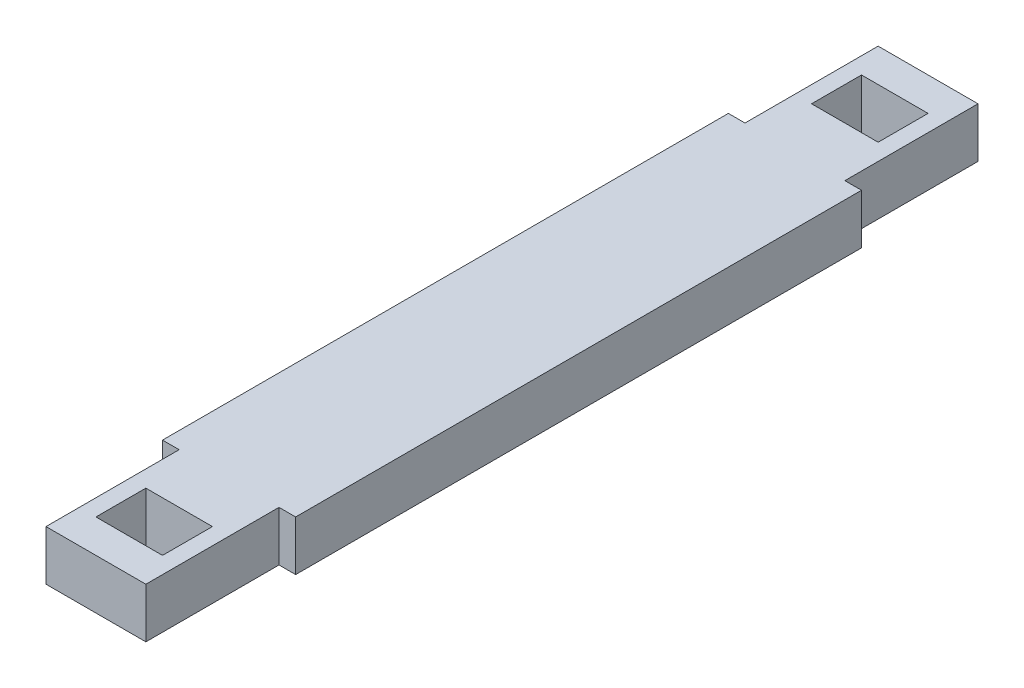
ISO-10303-21;
HEADER;
FILE_DESCRIPTION(('STEP AP214'),'2;1');
FILE_NAME('part.step','',(''),(''),'','','');
FILE_SCHEMA(('AUTOMOTIVE_DESIGN { 1 0 10303 214 1 1 1 1 }'));
ENDSEC;
DATA;
#1=APPLICATION_CONTEXT('core data for automotive mechanical design processes');
#2=APPLICATION_PROTOCOL_DEFINITION('international standard','automotive_design',2000,#1);
#3=PRODUCT_CONTEXT('',#1,'mechanical');
#4=PRODUCT('Part','Part','',(#3));
#5=PRODUCT_RELATED_PRODUCT_CATEGORY('part','',(#4));
#6=PRODUCT_DEFINITION_FORMATION('','',#4);
#7=PRODUCT_DEFINITION_CONTEXT('part definition',#1,'design');
#8=PRODUCT_DEFINITION('design','',#6,#7);
#9=PRODUCT_DEFINITION_SHAPE('','',#8);
#10=(LENGTH_UNIT() NAMED_UNIT(*) SI_UNIT(.MILLI.,.METRE.));
#11=(NAMED_UNIT(*) PLANE_ANGLE_UNIT() SI_UNIT($,.RADIAN.));
#12=(NAMED_UNIT(*) SI_UNIT($,.STERADIAN.) SOLID_ANGLE_UNIT());
#13=UNCERTAINTY_MEASURE_WITH_UNIT(LENGTH_MEASURE(1.E-05),#10,'distance_accuracy_value','');
#14=(GEOMETRIC_REPRESENTATION_CONTEXT(3) GLOBAL_UNCERTAINTY_ASSIGNED_CONTEXT((#13)) GLOBAL_UNIT_ASSIGNED_CONTEXT((#10,
#11,#12)) REPRESENTATION_CONTEXT('',''));
#15=CARTESIAN_POINT('',(0.,0.,0.));
#16=DIRECTION('',(0.,0.,1.));
#17=DIRECTION('',(1.,0.,0.));
#18=AXIS2_PLACEMENT_3D('',#15,#16,#17);
#19=CARTESIAN_POINT('',(15.,-7.5,250.));
#20=DIRECTION('',(-1.,0.,0.));
#21=DIRECTION('',(0.,0.,1.));
#22=AXIS2_PLACEMENT_3D('',#19,#20,#21);
#23=PLANE('',#22);
#24=DIRECTION('',(0.,0.,-1.));
#25=VECTOR('',#24,1.);
#26=CARTESIAN_POINT('',(15.,7.5,250.));
#27=LINE('',#26,#25);
#28=CARTESIAN_POINT('',(15.,7.5,40.));
#29=VERTEX_POINT('',#28);
#30=CARTESIAN_POINT('',(15.,7.5,0.));
#31=VERTEX_POINT('',#30);
#32=EDGE_CURVE('E54',#29,#31,#27,.T.);
#33=ORIENTED_EDGE('',*,*,#32,.F.);
#34=DIRECTION('',(0.,-1.,0.));
#35=VECTOR('',#34,1.);
#36=CARTESIAN_POINT('',(15.,-7.5,40.));
#37=LINE('',#36,#35);
#38=CARTESIAN_POINT('',(15.,-7.5,40.));
#39=VERTEX_POINT('',#38);
#40=EDGE_CURVE('E258',#29,#39,#37,.T.);
#41=ORIENTED_EDGE('',*,*,#40,.T.);
#42=DIRECTION('',(0.,0.,-1.));
#43=VECTOR('',#42,1.);
#44=CARTESIAN_POINT('',(15.,-7.5,250.));
#45=LINE('',#44,#43);
#46=CARTESIAN_POINT('',(15.,-7.5,0.));
#47=VERTEX_POINT('',#46);
#48=EDGE_CURVE('E365',#39,#47,#45,.T.);
#49=ORIENTED_EDGE('',*,*,#48,.T.);
#50=DIRECTION('',(0.,1.,0.));
#51=VECTOR('',#50,1.);
#52=CARTESIAN_POINT('',(15.,-7.5,0.));
#53=LINE('',#52,#51);
#54=EDGE_CURVE('E299',#47,#31,#53,.T.);
#55=ORIENTED_EDGE('',*,*,#54,.T.);
#56=EDGE_LOOP('',(#33,#41,#49,#55));
#57=FACE_BOUND('',#56,.T.);
#58=ADVANCED_FACE('F45',(#57),#23,.F.);
#59=CARTESIAN_POINT('',(-15.,-7.5,250.));
#60=DIRECTION('',(1.,0.,0.));
#61=DIRECTION('',(0.,0.,-1.));
#62=AXIS2_PLACEMENT_3D('',#59,#60,#61);
#63=PLANE('',#62);
#64=DIRECTION('',(0.,0.,-1.));
#65=VECTOR('',#64,1.);
#66=CARTESIAN_POINT('',(-15.,-7.5,250.));
#67=LINE('',#66,#65);
#68=CARTESIAN_POINT('',(-15.,-7.5,40.));
#69=VERTEX_POINT('',#68);
#70=CARTESIAN_POINT('',(-15.,-7.5,0.));
#71=VERTEX_POINT('',#70);
#72=EDGE_CURVE('E384',#69,#71,#67,.T.);
#73=ORIENTED_EDGE('',*,*,#72,.F.);
#74=DIRECTION('',(0.,1.,0.));
#75=VECTOR('',#74,1.);
#76=CARTESIAN_POINT('',(-15.,-7.5,40.));
#77=LINE('',#76,#75);
#78=CARTESIAN_POINT('',(-15.,7.5,40.));
#79=VERTEX_POINT('',#78);
#80=EDGE_CURVE('E254',#69,#79,#77,.T.);
#81=ORIENTED_EDGE('',*,*,#80,.T.);
#82=DIRECTION('',(0.,0.,-1.));
#83=VECTOR('',#82,1.);
#84=CARTESIAN_POINT('',(-15.,7.5,250.));
#85=LINE('',#84,#83);
#86=CARTESIAN_POINT('',(-15.,7.5,0.));
#87=VERTEX_POINT('',#86);
#88=EDGE_CURVE('E386',#79,#87,#85,.T.);
#89=ORIENTED_EDGE('',*,*,#88,.T.);
#90=DIRECTION('',(0.,-1.,0.));
#91=VECTOR('',#90,1.);
#92=CARTESIAN_POINT('',(-15.,-7.5,0.));
#93=LINE('',#92,#91);
#94=EDGE_CURVE('E373',#87,#71,#93,.T.);
#95=ORIENTED_EDGE('',*,*,#94,.T.);
#96=EDGE_LOOP('',(#73,#81,#89,#95));
#97=FACE_BOUND('',#96,.T.);
#98=ADVANCED_FACE('F391',(#97),#63,.F.);
#99=CARTESIAN_POINT('',(15.,-7.5,250.));
#100=VERTEX_POINT('',#99);
#101=CARTESIAN_POINT('',(15.,-7.5,210.));
#102=VERTEX_POINT('',#101);
#103=EDGE_CURVE('E380',#100,#102,#45,.T.);
#104=ORIENTED_EDGE('',*,*,#103,.T.);
#105=DIRECTION('',(0.,1.,0.));
#106=VECTOR('',#105,1.);
#107=CARTESIAN_POINT('',(15.,-7.5,210.));
#108=LINE('',#107,#106);
#109=CARTESIAN_POINT('',(15.,7.5,210.));
#110=VERTEX_POINT('',#109);
#111=EDGE_CURVE('E250',#102,#110,#108,.T.);
#112=ORIENTED_EDGE('',*,*,#111,.T.);
#113=CARTESIAN_POINT('',(15.,7.5,250.));
#114=VERTEX_POINT('',#113);
#115=EDGE_CURVE('E11',#114,#110,#27,.T.);
#116=ORIENTED_EDGE('',*,*,#115,.F.);
#117=DIRECTION('',(0.,1.,0.));
#118=VECTOR('',#117,1.);
#119=CARTESIAN_POINT('',(15.,-7.5,250.));
#120=LINE('',#119,#118);
#121=EDGE_CURVE('E351',#100,#114,#120,.T.);
#122=ORIENTED_EDGE('',*,*,#121,.F.);
#123=EDGE_LOOP('',(#104,#112,#116,#122));
#124=FACE_BOUND('',#123,.T.);
#125=ADVANCED_FACE('F47',(#124),#23,.F.);
#126=CARTESIAN_POINT('',(-15.,7.5,250.));
#127=DIRECTION('',(0.,-1.,0.));
#128=DIRECTION('',(0.,0.,-1.));
#129=AXIS2_PLACEMENT_3D('',#126,#127,#128);
#130=PLANE('',#129);
#131=DIRECTION('',(0.,0.,-1.));
#132=VECTOR('',#131,1.);
#133=CARTESIAN_POINT('',(9.99999999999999,7.5,240.));
#134=LINE('',#133,#132);
#135=CARTESIAN_POINT('',(9.99999999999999,7.5,240.));
#136=VERTEX_POINT('',#135);
#137=CARTESIAN_POINT('',(9.99999999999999,7.5,225.));
#138=VERTEX_POINT('',#137);
#139=EDGE_CURVE('E331',#136,#138,#134,.T.);
#140=ORIENTED_EDGE('',*,*,#139,.F.);
#141=DIRECTION('',(1.,0.,0.));
#142=VECTOR('',#141,1.);
#143=CARTESIAN_POINT('',(-10.,7.5,240.));
#144=LINE('',#143,#142);
#145=CARTESIAN_POINT('',(-10.,7.5,240.));
#146=VERTEX_POINT('',#145);
#147=EDGE_CURVE('E285',#146,#136,#144,.T.);
#148=ORIENTED_EDGE('',*,*,#147,.F.);
#149=DIRECTION('',(0.,0.,1.));
#150=VECTOR('',#149,1.);
#151=CARTESIAN_POINT('',(-10.,7.5,240.));
#152=LINE('',#151,#150);
#153=CARTESIAN_POINT('',(-10.,7.5,225.));
#154=VERTEX_POINT('',#153);
#155=EDGE_CURVE('E322',#154,#146,#152,.T.);
#156=ORIENTED_EDGE('',*,*,#155,.F.);
#157=DIRECTION('',(-1.,0.,0.));
#158=VECTOR('',#157,1.);
#159=CARTESIAN_POINT('',(-10.,7.5,225.));
#160=LINE('',#159,#158);
#161=EDGE_CURVE('E326',#138,#154,#160,.T.);
#162=ORIENTED_EDGE('',*,*,#161,.F.);
#163=EDGE_LOOP('',(#140,#148,#156,#162));
#164=FACE_BOUND('',#163,.T.);
#165=ORIENTED_EDGE('',*,*,#115,.T.);
#166=DIRECTION('',(1.,0.,0.));
#167=VECTOR('',#166,1.);
#168=CARTESIAN_POINT('',(-20.,7.5,210.));
#169=LINE('',#168,#167);
#170=CARTESIAN_POINT('',(20.,7.5,210.));
#171=VERTEX_POINT('',#170);
#172=EDGE_CURVE('E233',#110,#171,#169,.T.);
#173=ORIENTED_EDGE('',*,*,#172,.T.);
#174=DIRECTION('',(0.,0.,-1.));
#175=VECTOR('',#174,1.);
#176=CARTESIAN_POINT('',(20.,7.5,40.));
#177=LINE('',#176,#175);
#178=CARTESIAN_POINT('',(20.,7.5,40.));
#179=VERTEX_POINT('',#178);
#180=EDGE_CURVE('E236',#171,#179,#177,.T.);
#181=ORIENTED_EDGE('',*,*,#180,.T.);
#182=DIRECTION('',(-1.,0.,0.));
#183=VECTOR('',#182,1.);
#184=CARTESIAN_POINT('',(-20.,7.5,40.));
#185=LINE('',#184,#183);
#186=EDGE_CURVE('E61',#179,#29,#185,.T.);
#187=ORIENTED_EDGE('',*,*,#186,.T.);
#188=ORIENTED_EDGE('',*,*,#32,.T.);
#189=DIRECTION('',(-1.,0.,0.));
#190=VECTOR('',#189,1.);
#191=CARTESIAN_POINT('',(-15.,7.5,0.));
#192=LINE('',#191,#190);
#193=EDGE_CURVE('E369',#31,#87,#192,.T.);
#194=ORIENTED_EDGE('',*,*,#193,.T.);
#195=ORIENTED_EDGE('',*,*,#88,.F.);
#196=CARTESIAN_POINT('',(-20.,7.5,40.));
#197=VERTEX_POINT('',#196);
#198=EDGE_CURVE('E221',#79,#197,#185,.T.);
#199=ORIENTED_EDGE('',*,*,#198,.T.);
#200=DIRECTION('',(0.,0.,1.));
#201=VECTOR('',#200,1.);
#202=CARTESIAN_POINT('',(-20.,7.5,40.));
#203=LINE('',#202,#201);
#204=CARTESIAN_POINT('',(-20.,7.5,210.));
#205=VERTEX_POINT('',#204);
#206=EDGE_CURVE('E230',#197,#205,#203,.T.);
#207=ORIENTED_EDGE('',*,*,#206,.T.);
#208=CARTESIAN_POINT('',(-15.,7.5,210.));
#209=VERTEX_POINT('',#208);
#210=EDGE_CURVE('E190',#205,#209,#169,.T.);
#211=ORIENTED_EDGE('',*,*,#210,.T.);
#212=CARTESIAN_POINT('',(-15.,7.5,250.));
#213=VERTEX_POINT('',#212);
#214=EDGE_CURVE('E69',#213,#209,#85,.T.);
#215=ORIENTED_EDGE('',*,*,#214,.F.);
#216=DIRECTION('',(-1.,0.,0.));
#217=VECTOR('',#216,1.);
#218=CARTESIAN_POINT('',(-15.,7.5,250.));
#219=LINE('',#218,#217);
#220=EDGE_CURVE('E355',#114,#213,#219,.T.);
#221=ORIENTED_EDGE('',*,*,#220,.F.);
#222=EDGE_LOOP('',(#165,#173,#181,#187,#188,#194,#195,#199,#207,#211,#215,#221));
#223=FACE_BOUND('',#222,.T.);
#224=DIRECTION('',(1.,0.,0.));
#225=VECTOR('',#224,1.);
#226=CARTESIAN_POINT('',(-10.,7.5,25.));
#227=LINE('',#226,#225);
#228=CARTESIAN_POINT('',(-10.,7.5,25.));
#229=VERTEX_POINT('',#228);
#230=CARTESIAN_POINT('',(10.,7.5,25.));
#231=VERTEX_POINT('',#230);
#232=EDGE_CURVE('E284',#229,#231,#227,.T.);
#233=ORIENTED_EDGE('',*,*,#232,.F.);
#234=DIRECTION('',(0.,0.,1.));
#235=VECTOR('',#234,1.);
#236=CARTESIAN_POINT('',(-10.,7.5,10.));
#237=LINE('',#236,#235);
#238=CARTESIAN_POINT('',(-10.,7.5,10.));
#239=VERTEX_POINT('',#238);
#240=EDGE_CURVE('E281',#239,#229,#237,.T.);
#241=ORIENTED_EDGE('',*,*,#240,.F.);
#242=DIRECTION('',(-1.,0.,0.));
#243=VECTOR('',#242,1.);
#244=CARTESIAN_POINT('',(-10.,7.5,10.));
#245=LINE('',#244,#243);
#246=CARTESIAN_POINT('',(10.,7.5,10.));
#247=VERTEX_POINT('',#246);
#248=EDGE_CURVE('E268',#247,#239,#245,.T.);
#249=ORIENTED_EDGE('',*,*,#248,.F.);
#250=DIRECTION('',(0.,0.,-1.));
#251=VECTOR('',#250,1.);
#252=CARTESIAN_POINT('',(10.,7.5,10.));
#253=LINE('',#252,#251);
#254=EDGE_CURVE('E289',#231,#247,#253,.T.);
#255=ORIENTED_EDGE('',*,*,#254,.F.);
#256=EDGE_LOOP('',(#233,#241,#249,#255));
#257=FACE_BOUND('',#256,.T.);
#258=ADVANCED_FACE('F397',(#164,#223,#257),#130,.F.);
#259=ORIENTED_EDGE('',*,*,#214,.T.);
#260=DIRECTION('',(0.,-1.,0.));
#261=VECTOR('',#260,1.);
#262=CARTESIAN_POINT('',(-15.,-7.5,210.));
#263=LINE('',#262,#261);
#264=CARTESIAN_POINT('',(-15.,-7.5,210.));
#265=VERTEX_POINT('',#264);
#266=EDGE_CURVE('E241',#209,#265,#263,.T.);
#267=ORIENTED_EDGE('',*,*,#266,.T.);
#268=CARTESIAN_POINT('',(-15.,-7.5,250.));
#269=VERTEX_POINT('',#268);
#270=EDGE_CURVE('E208',#269,#265,#67,.T.);
#271=ORIENTED_EDGE('',*,*,#270,.F.);
#272=DIRECTION('',(0.,-1.,0.));
#273=VECTOR('',#272,1.);
#274=CARTESIAN_POINT('',(-15.,-7.5,250.));
#275=LINE('',#274,#273);
#276=EDGE_CURVE('E359',#213,#269,#275,.T.);
#277=ORIENTED_EDGE('',*,*,#276,.F.);
#278=EDGE_LOOP('',(#259,#267,#271,#277));
#279=FACE_BOUND('',#278,.T.);
#280=ADVANCED_FACE('F429',(#279),#63,.F.);
#281=CARTESIAN_POINT('',(-15.,-7.5,250.));
#282=DIRECTION('',(0.,1.,0.));
#283=DIRECTION('',(0.,0.,1.));
#284=AXIS2_PLACEMENT_3D('',#281,#282,#283);
#285=PLANE('',#284);
#286=DIRECTION('',(0.,0.,1.));
#287=VECTOR('',#286,1.);
#288=CARTESIAN_POINT('',(-10.,-7.5,240.));
#289=LINE('',#288,#287);
#290=CARTESIAN_POINT('',(-10.,-7.5,225.));
#291=VERTEX_POINT('',#290);
#292=CARTESIAN_POINT('',(-10.,-7.5,240.));
#293=VERTEX_POINT('',#292);
#294=EDGE_CURVE('E313',#291,#293,#289,.T.);
#295=ORIENTED_EDGE('',*,*,#294,.T.);
#296=DIRECTION('',(1.,0.,0.));
#297=VECTOR('',#296,1.);
#298=CARTESIAN_POINT('',(-10.,-7.5,240.));
#299=LINE('',#298,#297);
#300=CARTESIAN_POINT('',(9.99999999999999,-7.5,240.));
#301=VERTEX_POINT('',#300);
#302=EDGE_CURVE('E327',#293,#301,#299,.T.);
#303=ORIENTED_EDGE('',*,*,#302,.T.);
#304=DIRECTION('',(0.,0.,-1.));
#305=VECTOR('',#304,1.);
#306=CARTESIAN_POINT('',(9.99999999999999,-7.5,240.));
#307=LINE('',#306,#305);
#308=CARTESIAN_POINT('',(9.99999999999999,-7.5,225.));
#309=VERTEX_POINT('',#308);
#310=EDGE_CURVE('E344',#301,#309,#307,.T.);
#311=ORIENTED_EDGE('',*,*,#310,.T.);
#312=DIRECTION('',(-1.,0.,0.));
#313=VECTOR('',#312,1.);
#314=CARTESIAN_POINT('',(-10.,-7.5,225.));
#315=LINE('',#314,#313);
#316=EDGE_CURVE('E340',#309,#291,#315,.T.);
#317=ORIENTED_EDGE('',*,*,#316,.T.);
#318=EDGE_LOOP('',(#295,#303,#311,#317));
#319=FACE_BOUND('',#318,.T.);
#320=ORIENTED_EDGE('',*,*,#270,.T.);
#321=DIRECTION('',(1.,0.,0.));
#322=VECTOR('',#321,1.);
#323=CARTESIAN_POINT('',(-20.,-7.5,210.));
#324=LINE('',#323,#322);
#325=CARTESIAN_POINT('',(-20.,-7.5,210.));
#326=VERTEX_POINT('',#325);
#327=EDGE_CURVE('E188',#326,#265,#324,.T.);
#328=ORIENTED_EDGE('',*,*,#327,.F.);
#329=DIRECTION('',(0.,0.,1.));
#330=VECTOR('',#329,1.);
#331=CARTESIAN_POINT('',(-20.,-7.5,40.));
#332=LINE('',#331,#330);
#333=CARTESIAN_POINT('',(-20.,-7.5,40.));
#334=VERTEX_POINT('',#333);
#335=EDGE_CURVE('E205',#334,#326,#332,.T.);
#336=ORIENTED_EDGE('',*,*,#335,.F.);
#337=DIRECTION('',(-1.,0.,0.));
#338=VECTOR('',#337,1.);
#339=CARTESIAN_POINT('',(-20.,-7.5,40.));
#340=LINE('',#339,#338);
#341=EDGE_CURVE('E227',#69,#334,#340,.T.);
#342=ORIENTED_EDGE('',*,*,#341,.F.);
#343=ORIENTED_EDGE('',*,*,#72,.T.);
#344=DIRECTION('',(1.,0.,0.));
#345=VECTOR('',#344,1.);
#346=CARTESIAN_POINT('',(-15.,-7.5,0.));
#347=LINE('',#346,#345);
#348=EDGE_CURVE('E356',#71,#47,#347,.T.);
#349=ORIENTED_EDGE('',*,*,#348,.T.);
#350=ORIENTED_EDGE('',*,*,#48,.F.);
#351=CARTESIAN_POINT('',(20.,-7.5,40.));
#352=VERTEX_POINT('',#351);
#353=EDGE_CURVE('E197',#352,#39,#340,.T.);
#354=ORIENTED_EDGE('',*,*,#353,.F.);
#355=DIRECTION('',(0.,0.,-1.));
#356=VECTOR('',#355,1.);
#357=CARTESIAN_POINT('',(20.,-7.5,40.));
#358=LINE('',#357,#356);
#359=CARTESIAN_POINT('',(20.,-7.5,210.));
#360=VERTEX_POINT('',#359);
#361=EDGE_CURVE('E210',#360,#352,#358,.T.);
#362=ORIENTED_EDGE('',*,*,#361,.F.);
#363=EDGE_CURVE('E211',#102,#360,#324,.T.);
#364=ORIENTED_EDGE('',*,*,#363,.F.);
#365=ORIENTED_EDGE('',*,*,#103,.F.);
#366=DIRECTION('',(1.,0.,0.));
#367=VECTOR('',#366,1.);
#368=CARTESIAN_POINT('',(-15.,-7.5,250.));
#369=LINE('',#368,#367);
#370=EDGE_CURVE('E362',#269,#100,#369,.T.);
#371=ORIENTED_EDGE('',*,*,#370,.F.);
#372=EDGE_LOOP('',(#320,#328,#336,#342,#343,#349,#350,#354,#362,#364,#365,#371));
#373=FACE_BOUND('',#372,.T.);
#374=DIRECTION('',(-1.,0.,0.));
#375=VECTOR('',#374,1.);
#376=CARTESIAN_POINT('',(-10.,-7.5,10.));
#377=LINE('',#376,#375);
#378=CARTESIAN_POINT('',(10.,-7.5,10.));
#379=VERTEX_POINT('',#378);
#380=CARTESIAN_POINT('',(-10.,-7.5,10.));
#381=VERTEX_POINT('',#380);
#382=EDGE_CURVE('E276',#379,#381,#377,.T.);
#383=ORIENTED_EDGE('',*,*,#382,.T.);
#384=DIRECTION('',(0.,0.,1.));
#385=VECTOR('',#384,1.);
#386=CARTESIAN_POINT('',(-10.,-7.5,10.));
#387=LINE('',#386,#385);
#388=CARTESIAN_POINT('',(-10.,-7.5,25.));
#389=VERTEX_POINT('',#388);
#390=EDGE_CURVE('E263',#381,#389,#387,.T.);
#391=ORIENTED_EDGE('',*,*,#390,.T.);
#392=DIRECTION('',(1.,0.,0.));
#393=VECTOR('',#392,1.);
#394=CARTESIAN_POINT('',(-10.,-7.5,25.));
#395=LINE('',#394,#393);
#396=CARTESIAN_POINT('',(9.99999999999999,-7.5,25.));
#397=VERTEX_POINT('',#396);
#398=EDGE_CURVE('E267',#389,#397,#395,.T.);
#399=ORIENTED_EDGE('',*,*,#398,.T.);
#400=DIRECTION('',(0.,0.,-1.));
#401=VECTOR('',#400,1.);
#402=CARTESIAN_POINT('',(10.,-7.5,10.));
#403=LINE('',#402,#401);
#404=EDGE_CURVE('E272',#397,#379,#403,.T.);
#405=ORIENTED_EDGE('',*,*,#404,.T.);
#406=EDGE_LOOP('',(#383,#391,#399,#405));
#407=FACE_BOUND('',#406,.T.);
#408=ADVANCED_FACE('F202',(#319,#373,#407),#285,.F.);
#409=CARTESIAN_POINT('',(0.,0.,250.));
#410=DIRECTION('',(0.,0.,-1.));
#411=DIRECTION('',(-1.,0.,0.));
#412=AXIS2_PLACEMENT_3D('',#409,#410,#411);
#413=PLANE('',#412);
#414=ORIENTED_EDGE('',*,*,#121,.T.);
#415=ORIENTED_EDGE('',*,*,#220,.T.);
#416=ORIENTED_EDGE('',*,*,#276,.T.);
#417=ORIENTED_EDGE('',*,*,#370,.T.);
#418=EDGE_LOOP('',(#414,#415,#416,#417));
#419=FACE_BOUND('',#418,.T.);
#420=ADVANCED_FACE('F439',(#419),#413,.F.);
#421=CARTESIAN_POINT('',(0.,0.,0.));
#422=DIRECTION('',(0.,0.,-1.));
#423=DIRECTION('',(-1.,0.,0.));
#424=AXIS2_PLACEMENT_3D('',#421,#422,#423);
#425=PLANE('',#424);
#426=ORIENTED_EDGE('',*,*,#54,.F.);
#427=ORIENTED_EDGE('',*,*,#348,.F.);
#428=ORIENTED_EDGE('',*,*,#94,.F.);
#429=ORIENTED_EDGE('',*,*,#193,.F.);
#430=EDGE_LOOP('',(#426,#427,#428,#429));
#431=FACE_BOUND('',#430,.T.);
#432=ADVANCED_FACE('F402',(#431),#425,.T.);
#433=CARTESIAN_POINT('',(-10.,-7.5,240.));
#434=DIRECTION('',(0.,0.,1.));
#435=DIRECTION('',(1.,0.,0.));
#436=AXIS2_PLACEMENT_3D('',#433,#434,#435);
#437=PLANE('',#436);
#438=ORIENTED_EDGE('',*,*,#147,.T.);
#439=DIRECTION('',(0.,1.,0.));
#440=VECTOR('',#439,1.);
#441=CARTESIAN_POINT('',(9.99999999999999,-7.5,240.));
#442=LINE('',#441,#440);
#443=EDGE_CURVE('E309',#301,#136,#442,.T.);
#444=ORIENTED_EDGE('',*,*,#443,.F.);
#445=ORIENTED_EDGE('',*,*,#302,.F.);
#446=DIRECTION('',(0.,1.,0.));
#447=VECTOR('',#446,1.);
#448=CARTESIAN_POINT('',(-10.,-7.5,240.));
#449=LINE('',#448,#447);
#450=EDGE_CURVE('E262',#293,#146,#449,.T.);
#451=ORIENTED_EDGE('',*,*,#450,.T.);
#452=EDGE_LOOP('',(#438,#444,#445,#451));
#453=FACE_BOUND('',#452,.T.);
#454=ADVANCED_FACE('F449',(#453),#437,.F.);
#455=CARTESIAN_POINT('',(-10.,-7.5,240.));
#456=DIRECTION('',(-1.,0.,0.));
#457=DIRECTION('',(0.,0.,1.));
#458=AXIS2_PLACEMENT_3D('',#455,#456,#457);
#459=PLANE('',#458);
#460=ORIENTED_EDGE('',*,*,#155,.T.);
#461=ORIENTED_EDGE('',*,*,#450,.F.);
#462=ORIENTED_EDGE('',*,*,#294,.F.);
#463=DIRECTION('',(0.,1.,0.));
#464=VECTOR('',#463,1.);
#465=CARTESIAN_POINT('',(-10.,-7.5,225.));
#466=LINE('',#465,#464);
#467=EDGE_CURVE('E317',#291,#154,#466,.T.);
#468=ORIENTED_EDGE('',*,*,#467,.T.);
#469=EDGE_LOOP('',(#460,#461,#462,#468));
#470=FACE_BOUND('',#469,.T.);
#471=ADVANCED_FACE('F452',(#470),#459,.F.);
#472=CARTESIAN_POINT('',(-10.,-7.5,225.));
#473=DIRECTION('',(0.,0.,-1.));
#474=DIRECTION('',(-1.,0.,0.));
#475=AXIS2_PLACEMENT_3D('',#472,#473,#474);
#476=PLANE('',#475);
#477=ORIENTED_EDGE('',*,*,#161,.T.);
#478=ORIENTED_EDGE('',*,*,#467,.F.);
#479=ORIENTED_EDGE('',*,*,#316,.F.);
#480=DIRECTION('',(0.,1.,0.));
#481=VECTOR('',#480,1.);
#482=CARTESIAN_POINT('',(9.99999999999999,-7.5,225.));
#483=LINE('',#482,#481);
#484=EDGE_CURVE('E314',#309,#138,#483,.T.);
#485=ORIENTED_EDGE('',*,*,#484,.T.);
#486=EDGE_LOOP('',(#477,#478,#479,#485));
#487=FACE_BOUND('',#486,.T.);
#488=ADVANCED_FACE('F455',(#487),#476,.F.);
#489=CARTESIAN_POINT('',(9.99999999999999,-7.5,240.));
#490=DIRECTION('',(1.,0.,0.));
#491=DIRECTION('',(0.,0.,-1.));
#492=AXIS2_PLACEMENT_3D('',#489,#490,#491);
#493=PLANE('',#492);
#494=ORIENTED_EDGE('',*,*,#139,.T.);
#495=ORIENTED_EDGE('',*,*,#484,.F.);
#496=ORIENTED_EDGE('',*,*,#310,.F.);
#497=ORIENTED_EDGE('',*,*,#443,.T.);
#498=EDGE_LOOP('',(#494,#495,#496,#497));
#499=FACE_BOUND('',#498,.T.);
#500=ADVANCED_FACE('F459',(#499),#493,.F.);
#501=CARTESIAN_POINT('',(-10.,-7.5,10.));
#502=DIRECTION('',(-1.,0.,0.));
#503=DIRECTION('',(0.,0.,1.));
#504=AXIS2_PLACEMENT_3D('',#501,#502,#503);
#505=PLANE('',#504);
#506=ORIENTED_EDGE('',*,*,#240,.T.);
#507=DIRECTION('',(0.,1.,0.));
#508=VECTOR('',#507,1.);
#509=CARTESIAN_POINT('',(-10.,-7.5,25.));
#510=LINE('',#509,#508);
#511=EDGE_CURVE('E280',#389,#229,#510,.T.);
#512=ORIENTED_EDGE('',*,*,#511,.F.);
#513=ORIENTED_EDGE('',*,*,#390,.F.);
#514=DIRECTION('',(0.,1.,0.));
#515=VECTOR('',#514,1.);
#516=CARTESIAN_POINT('',(-10.,-7.5,10.));
#517=LINE('',#516,#515);
#518=EDGE_CURVE('E296',#381,#239,#517,.T.);
#519=ORIENTED_EDGE('',*,*,#518,.T.);
#520=EDGE_LOOP('',(#506,#512,#513,#519));
#521=FACE_BOUND('',#520,.T.);
#522=ADVANCED_FACE('F463',(#521),#505,.F.);
#523=CARTESIAN_POINT('',(-10.,-7.5,10.));
#524=DIRECTION('',(0.,0.,-1.));
#525=DIRECTION('',(-1.,0.,0.));
#526=AXIS2_PLACEMENT_3D('',#523,#524,#525);
#527=PLANE('',#526);
#528=ORIENTED_EDGE('',*,*,#248,.T.);
#529=ORIENTED_EDGE('',*,*,#518,.F.);
#530=ORIENTED_EDGE('',*,*,#382,.F.);
#531=DIRECTION('',(0.,1.,0.));
#532=VECTOR('',#531,1.);
#533=CARTESIAN_POINT('',(10.,-7.5,10.));
#534=LINE('',#533,#532);
#535=EDGE_CURVE('E300',#379,#247,#534,.T.);
#536=ORIENTED_EDGE('',*,*,#535,.T.);
#537=EDGE_LOOP('',(#528,#529,#530,#536));
#538=FACE_BOUND('',#537,.T.);
#539=ADVANCED_FACE('F470',(#538),#527,.F.);
#540=CARTESIAN_POINT('',(10.,-7.5,10.));
#541=DIRECTION('',(1.,0.,0.));
#542=DIRECTION('',(0.,0.,-1.));
#543=AXIS2_PLACEMENT_3D('',#540,#541,#542);
#544=PLANE('',#543);
#545=ORIENTED_EDGE('',*,*,#254,.T.);
#546=ORIENTED_EDGE('',*,*,#535,.F.);
#547=ORIENTED_EDGE('',*,*,#404,.F.);
#548=DIRECTION('',(0.,1.,0.));
#549=VECTOR('',#548,1.);
#550=CARTESIAN_POINT('',(10.,-7.5,25.));
#551=LINE('',#550,#549);
#552=EDGE_CURVE('E303',#397,#231,#551,.T.);
#553=ORIENTED_EDGE('',*,*,#552,.T.);
#554=EDGE_LOOP('',(#545,#546,#547,#553));
#555=FACE_BOUND('',#554,.T.);
#556=ADVANCED_FACE('F475',(#555),#544,.F.);
#557=CARTESIAN_POINT('',(-10.,-7.5,25.));
#558=DIRECTION('',(0.,0.,1.));
#559=DIRECTION('',(1.,0.,0.));
#560=AXIS2_PLACEMENT_3D('',#557,#558,#559);
#561=PLANE('',#560);
#562=ORIENTED_EDGE('',*,*,#232,.T.);
#563=ORIENTED_EDGE('',*,*,#552,.F.);
#564=ORIENTED_EDGE('',*,*,#398,.F.);
#565=ORIENTED_EDGE('',*,*,#511,.T.);
#566=EDGE_LOOP('',(#562,#563,#564,#565));
#567=FACE_BOUND('',#566,.T.);
#568=ADVANCED_FACE('F472',(#567),#561,.F.);
#569=CARTESIAN_POINT('',(-20.,-7.5,40.));
#570=DIRECTION('',(-1.,0.,0.));
#571=DIRECTION('',(0.,0.,1.));
#572=AXIS2_PLACEMENT_3D('',#569,#570,#571);
#573=PLANE('',#572);
#574=ORIENTED_EDGE('',*,*,#206,.F.);
#575=DIRECTION('',(0.,1.,0.));
#576=VECTOR('',#575,1.);
#577=CARTESIAN_POINT('',(-20.,-7.5,40.));
#578=LINE('',#577,#576);
#579=EDGE_CURVE('E216',#334,#197,#578,.T.);
#580=ORIENTED_EDGE('',*,*,#579,.F.);
#581=ORIENTED_EDGE('',*,*,#335,.T.);
#582=DIRECTION('',(0.,1.,0.));
#583=VECTOR('',#582,1.);
#584=CARTESIAN_POINT('',(-20.,-7.5,210.));
#585=LINE('',#584,#583);
#586=EDGE_CURVE('E185',#326,#205,#585,.T.);
#587=ORIENTED_EDGE('',*,*,#586,.T.);
#588=EDGE_LOOP('',(#574,#580,#581,#587));
#589=FACE_BOUND('',#588,.T.);
#590=ADVANCED_FACE('F214',(#589),#573,.T.);
#591=CARTESIAN_POINT('',(-20.,-7.5,210.));
#592=DIRECTION('',(0.,0.,1.));
#593=DIRECTION('',(1.,0.,0.));
#594=AXIS2_PLACEMENT_3D('',#591,#592,#593);
#595=PLANE('',#594);
#596=ORIENTED_EDGE('',*,*,#266,.F.);
#597=ORIENTED_EDGE('',*,*,#210,.F.);
#598=ORIENTED_EDGE('',*,*,#586,.F.);
#599=ORIENTED_EDGE('',*,*,#327,.T.);
#600=EDGE_LOOP('',(#596,#597,#598,#599));
#601=FACE_BOUND('',#600,.T.);
#602=ADVANCED_FACE('F187',(#601),#595,.T.);
#603=CARTESIAN_POINT('',(-20.,-7.5,40.));
#604=DIRECTION('',(0.,0.,-1.));
#605=DIRECTION('',(-1.,0.,0.));
#606=AXIS2_PLACEMENT_3D('',#603,#604,#605);
#607=PLANE('',#606);
#608=ORIENTED_EDGE('',*,*,#80,.F.);
#609=ORIENTED_EDGE('',*,*,#341,.T.);
#610=ORIENTED_EDGE('',*,*,#579,.T.);
#611=ORIENTED_EDGE('',*,*,#198,.F.);
#612=EDGE_LOOP('',(#608,#609,#610,#611));
#613=FACE_BOUND('',#612,.T.);
#614=ADVANCED_FACE('F409',(#613),#607,.T.);
#615=ORIENTED_EDGE('',*,*,#40,.F.);
#616=ORIENTED_EDGE('',*,*,#186,.F.);
#617=DIRECTION('',(0.,1.,0.));
#618=VECTOR('',#617,1.);
#619=CARTESIAN_POINT('',(20.,-7.5,40.));
#620=LINE('',#619,#618);
#621=EDGE_CURVE('E242',#352,#179,#620,.T.);
#622=ORIENTED_EDGE('',*,*,#621,.F.);
#623=ORIENTED_EDGE('',*,*,#353,.T.);
#624=EDGE_LOOP('',(#615,#616,#622,#623));
#625=FACE_BOUND('',#624,.T.);
#626=ADVANCED_FACE('F422',(#625),#607,.T.);
#627=ORIENTED_EDGE('',*,*,#111,.F.);
#628=ORIENTED_EDGE('',*,*,#363,.T.);
#629=DIRECTION('',(0.,1.,0.));
#630=VECTOR('',#629,1.);
#631=CARTESIAN_POINT('',(20.,-7.5,210.));
#632=LINE('',#631,#630);
#633=EDGE_CURVE('E196',#360,#171,#632,.T.);
#634=ORIENTED_EDGE('',*,*,#633,.T.);
#635=ORIENTED_EDGE('',*,*,#172,.F.);
#636=EDGE_LOOP('',(#627,#628,#634,#635));
#637=FACE_BOUND('',#636,.T.);
#638=ADVANCED_FACE('F416',(#637),#595,.T.);
#639=CARTESIAN_POINT('',(20.,-7.5,40.));
#640=DIRECTION('',(1.,0.,0.));
#641=DIRECTION('',(0.,0.,-1.));
#642=AXIS2_PLACEMENT_3D('',#639,#640,#641);
#643=PLANE('',#642);
#644=ORIENTED_EDGE('',*,*,#180,.F.);
#645=ORIENTED_EDGE('',*,*,#633,.F.);
#646=ORIENTED_EDGE('',*,*,#361,.T.);
#647=ORIENTED_EDGE('',*,*,#621,.T.);
#648=EDGE_LOOP('',(#644,#645,#646,#647));
#649=FACE_BOUND('',#648,.T.);
#650=ADVANCED_FACE('F420',(#649),#643,.T.);
#651=CLOSED_SHELL('',(#58,#98,#125,#258,#280,#408,#420,#432,#454,#471,#488,#500,#522,#539,#556,
#568,#590,#602,#614,#626,#638,#650));
#652=MANIFOLD_SOLID_BREP('B2',#651);
#653=ADVANCED_BREP_SHAPE_REPRESENTATION('',(#18,#652),#14);
#654=SHAPE_DEFINITION_REPRESENTATION(#9,#653);
ENDSEC;
END-ISO-10303-21;
